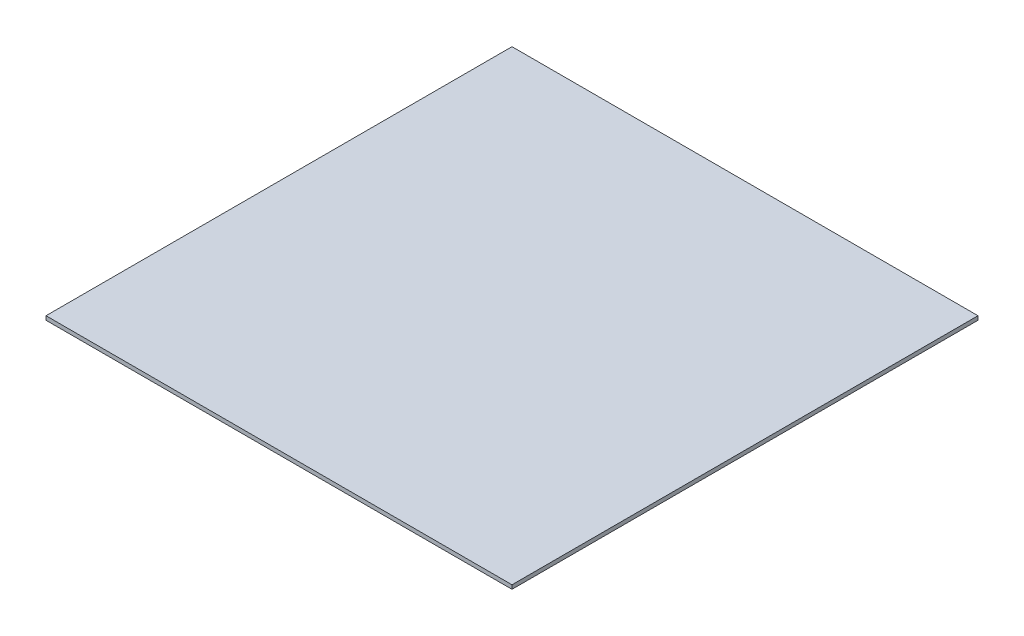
from build123d import *

# Parameters (mm, degrees)
SKETCH1_W           = 186.944
SKETCH1_H           = 186.944
BOSS_EXTRUDE1_DEPTH = 1.5875


with BuildPart() as part:
    # Sketch1 → Boss-Extrude1 (new body)
    with BuildSketch(Plane(origin=(0, 0, 0), x_dir=(1, 0, 0), z_dir=(0, 1, 0))):
        Rectangle(SKETCH1_W, SKETCH1_H)
    extrude(amount=BOSS_EXTRUDE1_DEPTH)


solid = part.part
